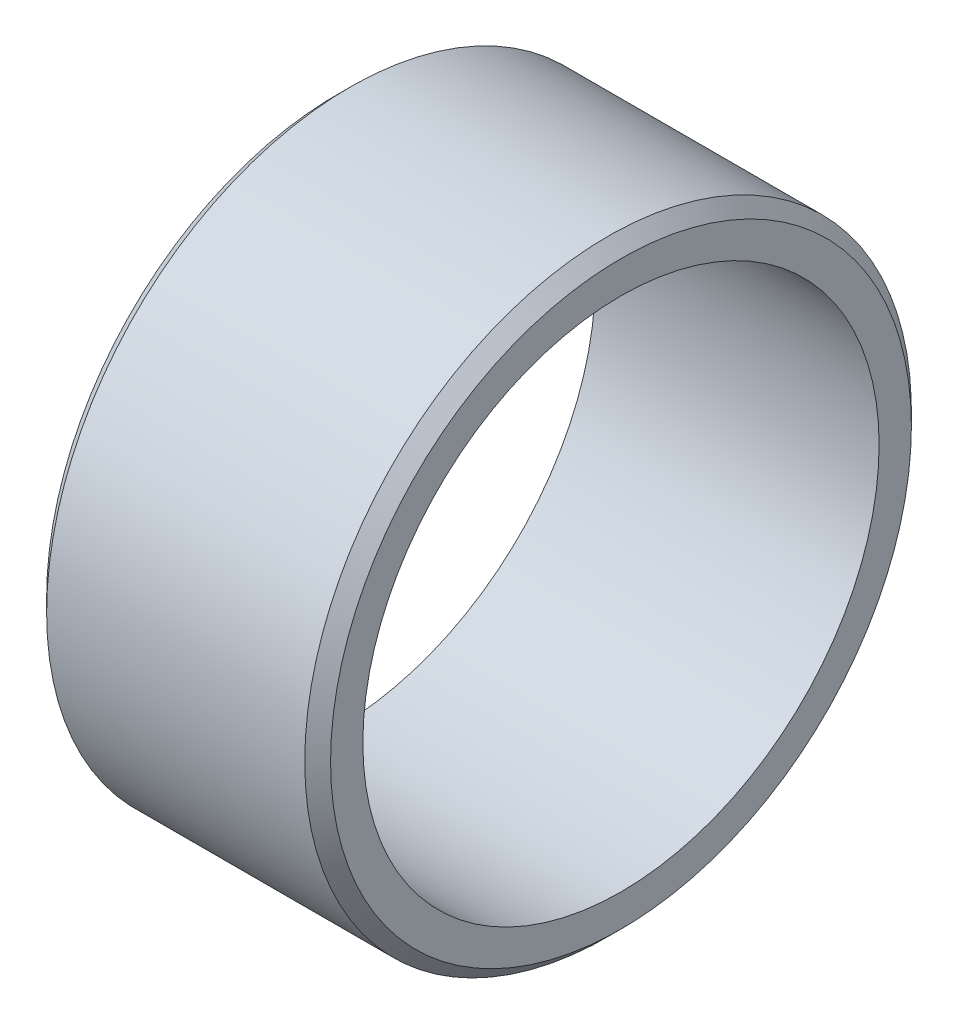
from build123d import *


with BuildPart() as part:
    # Esquisse1 → R_volution1 (revolve)
    with BuildSketch(Plane.XY, mode=Mode.PRIVATE) as r_volution1_sk:
        Polygon((-1, 23.5), (0, 22.5), (0, 20), (-22, 20), (-22, 22.5), (-21, 23.5), align=None)
    revolve(r_volution1_sk.sketch.rotate(Axis((-20.6639399, 0, 0), (1, 0, 0)), 90), axis=Axis((-20.6639399, 0, 0), (1, 0, 0)))


solid = part.part
